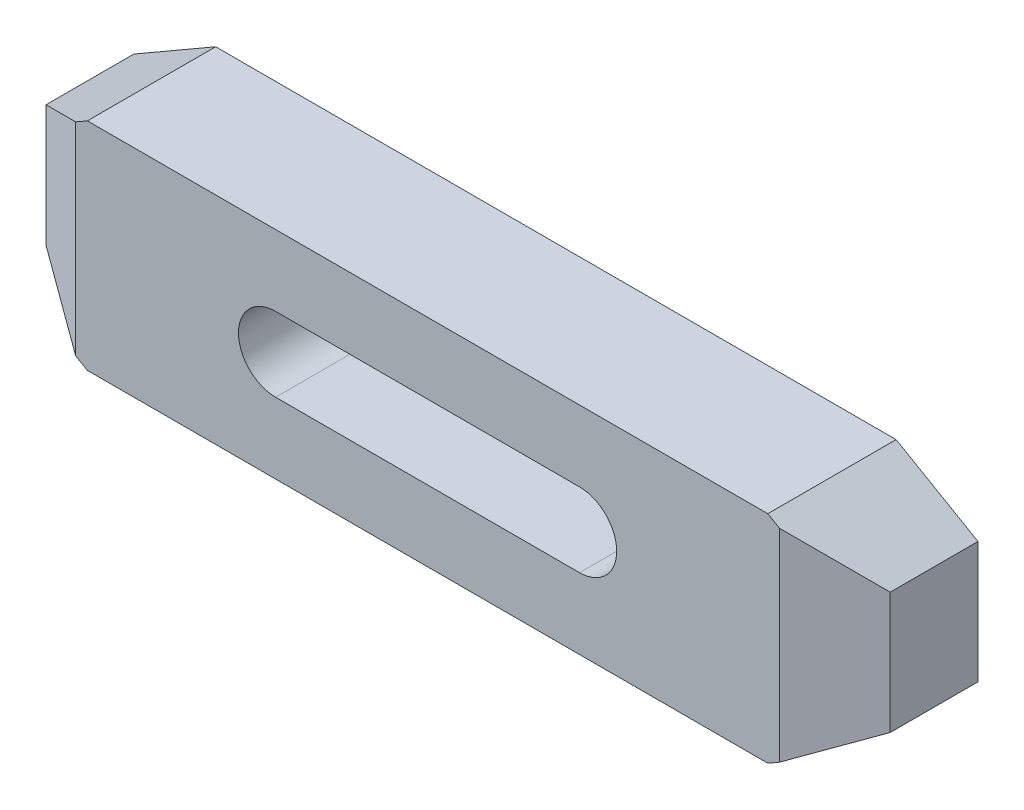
ISO-10303-21;
HEADER;
FILE_DESCRIPTION(('STEP AP214'),'2;1');
FILE_NAME('part.step','',(''),(''),'','','');
FILE_SCHEMA(('AUTOMOTIVE_DESIGN { 1 0 10303 214 1 1 1 1 }'));
ENDSEC;
DATA;
#1=APPLICATION_CONTEXT('core data for automotive mechanical design processes');
#2=APPLICATION_PROTOCOL_DEFINITION('international standard','automotive_design',2000,#1);
#3=PRODUCT_CONTEXT('',#1,'mechanical');
#4=PRODUCT('Part','Part','',(#3));
#5=PRODUCT_RELATED_PRODUCT_CATEGORY('part','',(#4));
#6=PRODUCT_DEFINITION_FORMATION('','',#4);
#7=PRODUCT_DEFINITION_CONTEXT('part definition',#1,'design');
#8=PRODUCT_DEFINITION('design','',#6,#7);
#9=PRODUCT_DEFINITION_SHAPE('','',#8);
#10=(LENGTH_UNIT() NAMED_UNIT(*) SI_UNIT(.MILLI.,.METRE.));
#11=(NAMED_UNIT(*) PLANE_ANGLE_UNIT() SI_UNIT($,.RADIAN.));
#12=(NAMED_UNIT(*) SI_UNIT($,.STERADIAN.) SOLID_ANGLE_UNIT());
#13=UNCERTAINTY_MEASURE_WITH_UNIT(LENGTH_MEASURE(1.E-05),#10,'distance_accuracy_value','');
#14=(GEOMETRIC_REPRESENTATION_CONTEXT(3) GLOBAL_UNCERTAINTY_ASSIGNED_CONTEXT((#13)) GLOBAL_UNIT_ASSIGNED_CONTEXT((#10,
#11,#12)) REPRESENTATION_CONTEXT('',''));
#15=CARTESIAN_POINT('',(0.,0.,0.));
#16=DIRECTION('',(0.,0.,1.));
#17=DIRECTION('',(1.,0.,0.));
#18=AXIS2_PLACEMENT_3D('',#15,#16,#17);
#19=CARTESIAN_POINT('',(0.,-45.0843918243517,19.));
#20=DIRECTION('',(0.,0.,-1.));
#21=DIRECTION('',(-1.,0.,0.));
#22=AXIS2_PLACEMENT_3D('',#19,#20,#21);
#23=PLANE('',#22);
#24=CARTESIAN_POINT('',(22.5,0.,19.));
#25=DIRECTION('',(0.,0.,1.));
#26=DIRECTION('',(1.,0.,0.));
#27=AXIS2_PLACEMENT_3D('',#24,#25,#26);
#28=CIRCLE('',#27,5.5);
#29=CARTESIAN_POINT('',(22.5,-5.5,19.));
#30=VERTEX_POINT('',#29);
#31=CARTESIAN_POINT('',(22.5,5.5,19.));
#32=VERTEX_POINT('',#31);
#33=EDGE_CURVE('E221',#30,#32,#28,.T.);
#34=ORIENTED_EDGE('',*,*,#33,.F.);
#35=DIRECTION('',(-1.,0.,0.));
#36=VECTOR('',#35,1.);
#37=CARTESIAN_POINT('',(22.5,-5.5,19.));
#38=LINE('',#37,#36);
#39=CARTESIAN_POINT('',(-22.5,-5.5,19.));
#40=VERTEX_POINT('',#39);
#41=EDGE_CURVE('E220',#30,#40,#38,.T.);
#42=ORIENTED_EDGE('',*,*,#41,.T.);
#43=CARTESIAN_POINT('',(-22.5,0.,19.));
#44=DIRECTION('',(0.,0.,1.));
#45=DIRECTION('',(1.,0.,0.));
#46=AXIS2_PLACEMENT_3D('',#43,#44,#45);
#47=CIRCLE('',#46,5.5);
#48=CARTESIAN_POINT('',(-22.5,5.5,19.));
#49=VERTEX_POINT('',#48);
#50=EDGE_CURVE('E228',#49,#40,#47,.T.);
#51=ORIENTED_EDGE('',*,*,#50,.F.);
#52=DIRECTION('',(-1.,0.,0.));
#53=VECTOR('',#52,1.);
#54=CARTESIAN_POINT('',(22.5,5.5,19.));
#55=LINE('',#54,#53);
#56=EDGE_CURVE('E224',#32,#49,#55,.T.);
#57=ORIENTED_EDGE('',*,*,#56,.F.);
#58=EDGE_LOOP('',(#34,#42,#51,#57));
#59=FACE_BOUND('',#58,.T.);
#60=DIRECTION('',(0.,1.,0.));
#61=VECTOR('',#60,1.);
#62=CARTESIAN_POINT('',(-52.1076951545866,-45.0843918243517,19.));
#63=LINE('',#62,#61);
#64=CARTESIAN_POINT('',(-52.1076951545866,-15.,19.));
#65=VERTEX_POINT('',#64);
#66=CARTESIAN_POINT('',(-52.1076951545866,15.,19.));
#67=VERTEX_POINT('',#66);
#68=EDGE_CURVE('E115',#65,#67,#63,.T.);
#69=ORIENTED_EDGE('',*,*,#68,.F.);
#70=DIRECTION('',(-0.866025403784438,0.5,0.));
#71=VECTOR('',#70,1.);
#72=CARTESIAN_POINT('',(-50.3756443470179,-16.,19.));
#73=LINE('',#72,#71);
#74=CARTESIAN_POINT('',(-50.3756443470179,-16.,19.));
#75=VERTEX_POINT('',#74);
#76=EDGE_CURVE('E174',#75,#65,#73,.T.);
#77=ORIENTED_EDGE('',*,*,#76,.F.);
#78=DIRECTION('',(-1.,0.,0.));
#79=VECTOR('',#78,1.);
#80=CARTESIAN_POINT('',(50.3756443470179,-16.,19.));
#81=LINE('',#80,#79);
#82=CARTESIAN_POINT('',(50.3756443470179,-16.,19.));
#83=VERTEX_POINT('',#82);
#84=EDGE_CURVE('E177',#83,#75,#81,.T.);
#85=ORIENTED_EDGE('',*,*,#84,.F.);
#86=DIRECTION('',(-0.866025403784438,-0.5,0.));
#87=VECTOR('',#86,1.);
#88=CARTESIAN_POINT('',(62.5,-9.,19.));
#89=LINE('',#88,#87);
#90=CARTESIAN_POINT('',(52.1076951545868,-15.,19.));
#91=VERTEX_POINT('',#90);
#92=EDGE_CURVE('E157',#91,#83,#89,.T.);
#93=ORIENTED_EDGE('',*,*,#92,.F.);
#94=DIRECTION('',(0.,1.,0.));
#95=VECTOR('',#94,1.);
#96=CARTESIAN_POINT('',(52.1076951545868,-45.0843918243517,19.));
#97=LINE('',#96,#95);
#98=CARTESIAN_POINT('',(52.1076951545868,15.,19.));
#99=VERTEX_POINT('',#98);
#100=EDGE_CURVE('E146',#91,#99,#97,.T.);
#101=ORIENTED_EDGE('',*,*,#100,.T.);
#102=DIRECTION('',(0.866025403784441,-0.5,0.));
#103=VECTOR('',#102,1.);
#104=CARTESIAN_POINT('',(50.3756443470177,16.,19.));
#105=LINE('',#104,#103);
#106=CARTESIAN_POINT('',(50.3756443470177,16.,19.));
#107=VERTEX_POINT('',#106);
#108=EDGE_CURVE('E155',#107,#99,#105,.T.);
#109=ORIENTED_EDGE('',*,*,#108,.F.);
#110=DIRECTION('',(1.,0.,0.));
#111=VECTOR('',#110,1.);
#112=CARTESIAN_POINT('',(-50.3756443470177,16.,19.));
#113=LINE('',#112,#111);
#114=CARTESIAN_POINT('',(-50.3756443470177,16.,19.));
#115=VERTEX_POINT('',#114);
#116=EDGE_CURVE('E164',#115,#107,#113,.T.);
#117=ORIENTED_EDGE('',*,*,#116,.F.);
#118=DIRECTION('',(0.866025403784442,0.5,0.));
#119=VECTOR('',#118,1.);
#120=CARTESIAN_POINT('',(-62.5,9.,19.));
#121=LINE('',#120,#119);
#122=EDGE_CURVE('E167',#67,#115,#121,.T.);
#123=ORIENTED_EDGE('',*,*,#122,.F.);
#124=EDGE_LOOP('',(#69,#77,#85,#93,#101,#109,#117,#123));
#125=FACE_BOUND('',#124,.T.);
#126=ADVANCED_FACE('F14',(#59,#125),#23,.F.);
#127=CARTESIAN_POINT('',(-62.5,9.,19.));
#128=DIRECTION('',(-0.5,0.866025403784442,0.));
#129=DIRECTION('',(-0.866025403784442,-0.5,0.));
#130=AXIS2_PLACEMENT_3D('',#127,#128,#129);
#131=PLANE('',#130);
#132=DIRECTION('',(0.,0.,-1.));
#133=VECTOR('',#132,1.);
#134=CARTESIAN_POINT('',(-62.5,9.,19.));
#135=LINE('',#134,#133);
#136=CARTESIAN_POINT('',(-62.5,9.,13.));
#137=VERTEX_POINT('',#136);
#138=CARTESIAN_POINT('',(-62.5,9.,0.));
#139=VERTEX_POINT('',#138);
#140=EDGE_CURVE('E124',#137,#139,#135,.T.);
#141=ORIENTED_EDGE('',*,*,#140,.F.);
#142=DIRECTION('',(0.774596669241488,0.447213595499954,0.447213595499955));
#143=VECTOR('',#142,1.);
#144=CARTESIAN_POINT('',(-60.4215390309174,10.2,14.2));
#145=LINE('',#144,#143);
#146=EDGE_CURVE('E112',#137,#67,#145,.T.);
#147=ORIENTED_EDGE('',*,*,#146,.T.);
#148=ORIENTED_EDGE('',*,*,#122,.T.);
#149=DIRECTION('',(0.,0.,-1.));
#150=VECTOR('',#149,1.);
#151=CARTESIAN_POINT('',(-50.3756443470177,16.,19.));
#152=LINE('',#151,#150);
#153=CARTESIAN_POINT('',(-50.3756443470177,16.,0.));
#154=VERTEX_POINT('',#153);
#155=EDGE_CURVE('E132',#115,#154,#152,.T.);
#156=ORIENTED_EDGE('',*,*,#155,.T.);
#157=DIRECTION('',(0.866025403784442,0.5,0.));
#158=VECTOR('',#157,1.);
#159=CARTESIAN_POINT('',(-62.5,9.,0.));
#160=LINE('',#159,#158);
#161=EDGE_CURVE('E131',#139,#154,#160,.T.);
#162=ORIENTED_EDGE('',*,*,#161,.F.);
#163=EDGE_LOOP('',(#141,#147,#148,#156,#162));
#164=FACE_BOUND('',#163,.T.);
#165=ADVANCED_FACE('F129',(#164),#131,.T.);
#166=CARTESIAN_POINT('',(-62.5,-9.,19.));
#167=DIRECTION('',(-1.,0.,0.));
#168=DIRECTION('',(0.,0.,1.));
#169=AXIS2_PLACEMENT_3D('',#166,#167,#168);
#170=PLANE('',#169);
#171=DIRECTION('',(0.,0.,-1.));
#172=VECTOR('',#171,1.);
#173=CARTESIAN_POINT('',(-62.5,-9.,19.));
#174=LINE('',#173,#172);
#175=CARTESIAN_POINT('',(-62.5,-9.,13.));
#176=VERTEX_POINT('',#175);
#177=CARTESIAN_POINT('',(-62.5,-9.,0.));
#178=VERTEX_POINT('',#177);
#179=EDGE_CURVE('E126',#176,#178,#174,.T.);
#180=ORIENTED_EDGE('',*,*,#179,.F.);
#181=DIRECTION('',(0.,1.,0.));
#182=VECTOR('',#181,1.);
#183=CARTESIAN_POINT('',(-62.5,-20.,13.));
#184=LINE('',#183,#182);
#185=EDGE_CURVE('E29',#176,#137,#184,.T.);
#186=ORIENTED_EDGE('',*,*,#185,.T.);
#187=ORIENTED_EDGE('',*,*,#140,.T.);
#188=DIRECTION('',(0.,1.,0.));
#189=VECTOR('',#188,1.);
#190=CARTESIAN_POINT('',(-62.5,-9.,0.));
#191=LINE('',#190,#189);
#192=EDGE_CURVE('E199',#178,#139,#191,.T.);
#193=ORIENTED_EDGE('',*,*,#192,.F.);
#194=EDGE_LOOP('',(#180,#186,#187,#193));
#195=FACE_BOUND('',#194,.T.);
#196=ADVANCED_FACE('F122',(#195),#170,.T.);
#197=CARTESIAN_POINT('',(-50.3756443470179,-16.,19.));
#198=DIRECTION('',(-0.5,-0.866025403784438,0.));
#199=DIRECTION('',(0.866025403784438,-0.5,0.));
#200=AXIS2_PLACEMENT_3D('',#197,#198,#199);
#201=PLANE('',#200);
#202=ORIENTED_EDGE('',*,*,#76,.T.);
#203=DIRECTION('',(-0.774596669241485,0.447213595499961,-0.447213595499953));
#204=VECTOR('',#203,1.);
#205=CARTESIAN_POINT('',(-50.7220545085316,-15.8,19.8));
#206=LINE('',#205,#204);
#207=EDGE_CURVE('E9',#65,#176,#206,.T.);
#208=ORIENTED_EDGE('',*,*,#207,.T.);
#209=ORIENTED_EDGE('',*,*,#179,.T.);
#210=DIRECTION('',(-0.866025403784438,0.5,0.));
#211=VECTOR('',#210,1.);
#212=CARTESIAN_POINT('',(-50.3756443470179,-16.,0.));
#213=LINE('',#212,#211);
#214=CARTESIAN_POINT('',(-50.3756443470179,-16.,0.));
#215=VERTEX_POINT('',#214);
#216=EDGE_CURVE('E195',#215,#178,#213,.T.);
#217=ORIENTED_EDGE('',*,*,#216,.F.);
#218=DIRECTION('',(0.,0.,-1.));
#219=VECTOR('',#218,1.);
#220=CARTESIAN_POINT('',(-50.3756443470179,-16.,19.));
#221=LINE('',#220,#219);
#222=EDGE_CURVE('E136',#75,#215,#221,.T.);
#223=ORIENTED_EDGE('',*,*,#222,.F.);
#224=EDGE_LOOP('',(#202,#208,#209,#217,#223));
#225=FACE_BOUND('',#224,.T.);
#226=ADVANCED_FACE('F198',(#225),#201,.T.);
#227=CARTESIAN_POINT('',(0.,-45.0843918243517,0.));
#228=DIRECTION('',(0.,0.,-1.));
#229=DIRECTION('',(-1.,0.,0.));
#230=AXIS2_PLACEMENT_3D('',#227,#228,#229);
#231=PLANE('',#230);
#232=DIRECTION('',(-0.866025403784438,-0.5,0.));
#233=VECTOR('',#232,1.);
#234=CARTESIAN_POINT('',(62.5,-9.,0.));
#235=LINE('',#234,#233);
#236=CARTESIAN_POINT('',(62.5,-9.,0.));
#237=VERTEX_POINT('',#236);
#238=CARTESIAN_POINT('',(50.3756443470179,-16.,0.));
#239=VERTEX_POINT('',#238);
#240=EDGE_CURVE('E170',#237,#239,#235,.T.);
#241=ORIENTED_EDGE('',*,*,#240,.T.);
#242=DIRECTION('',(-1.,0.,0.));
#243=VECTOR('',#242,1.);
#244=CARTESIAN_POINT('',(50.3756443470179,-16.,0.));
#245=LINE('',#244,#243);
#246=EDGE_CURVE('E186',#239,#215,#245,.T.);
#247=ORIENTED_EDGE('',*,*,#246,.T.);
#248=ORIENTED_EDGE('',*,*,#216,.T.);
#249=ORIENTED_EDGE('',*,*,#192,.T.);
#250=ORIENTED_EDGE('',*,*,#161,.T.);
#251=DIRECTION('',(1.,0.,0.));
#252=VECTOR('',#251,1.);
#253=CARTESIAN_POINT('',(-50.3756443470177,16.,0.));
#254=LINE('',#253,#252);
#255=CARTESIAN_POINT('',(50.3756443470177,16.,0.));
#256=VERTEX_POINT('',#255);
#257=EDGE_CURVE('E204',#154,#256,#254,.T.);
#258=ORIENTED_EDGE('',*,*,#257,.T.);
#259=DIRECTION('',(0.866025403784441,-0.5,0.));
#260=VECTOR('',#259,1.);
#261=CARTESIAN_POINT('',(50.3756443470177,16.,0.));
#262=LINE('',#261,#260);
#263=CARTESIAN_POINT('',(62.5,9.,0.));
#264=VERTEX_POINT('',#263);
#265=EDGE_CURVE('E207',#256,#264,#262,.T.);
#266=ORIENTED_EDGE('',*,*,#265,.T.);
#267=DIRECTION('',(0.,-1.,0.));
#268=VECTOR('',#267,1.);
#269=CARTESIAN_POINT('',(62.5,9.,0.));
#270=LINE('',#269,#268);
#271=EDGE_CURVE('E180',#264,#237,#270,.T.);
#272=ORIENTED_EDGE('',*,*,#271,.T.);
#273=EDGE_LOOP('',(#241,#247,#248,#249,#250,#258,#266,#272));
#274=FACE_BOUND('',#273,.T.);
#275=DIRECTION('',(-1.,0.,0.));
#276=VECTOR('',#275,1.);
#277=CARTESIAN_POINT('',(22.5,-5.5,0.));
#278=LINE('',#277,#276);
#279=CARTESIAN_POINT('',(22.5,-5.5,0.));
#280=VERTEX_POINT('',#279);
#281=CARTESIAN_POINT('',(-22.5,-5.5,0.));
#282=VERTEX_POINT('',#281);
#283=EDGE_CURVE('E225',#280,#282,#278,.T.);
#284=ORIENTED_EDGE('',*,*,#283,.F.);
#285=CARTESIAN_POINT('',(22.5,0.,0.));
#286=DIRECTION('',(0.,0.,1.));
#287=DIRECTION('',(1.,0.,0.));
#288=AXIS2_PLACEMENT_3D('',#285,#286,#287);
#289=CIRCLE('',#288,5.5);
#290=CARTESIAN_POINT('',(22.5,5.5,0.));
#291=VERTEX_POINT('',#290);
#292=EDGE_CURVE('E232',#280,#291,#289,.T.);
#293=ORIENTED_EDGE('',*,*,#292,.T.);
#294=DIRECTION('',(-1.,0.,0.));
#295=VECTOR('',#294,1.);
#296=CARTESIAN_POINT('',(22.5,5.5,0.));
#297=LINE('',#296,#295);
#298=CARTESIAN_POINT('',(-22.5,5.5,0.));
#299=VERTEX_POINT('',#298);
#300=EDGE_CURVE('E235',#291,#299,#297,.T.);
#301=ORIENTED_EDGE('',*,*,#300,.T.);
#302=CARTESIAN_POINT('',(-22.5,0.,0.));
#303=DIRECTION('',(0.,0.,1.));
#304=DIRECTION('',(1.,0.,0.));
#305=AXIS2_PLACEMENT_3D('',#302,#303,#304);
#306=CIRCLE('',#305,5.5);
#307=EDGE_CURVE('E238',#299,#282,#306,.T.);
#308=ORIENTED_EDGE('',*,*,#307,.T.);
#309=EDGE_LOOP('',(#284,#293,#301,#308));
#310=FACE_BOUND('',#309,.T.);
#311=ADVANCED_FACE('F193',(#274,#310),#231,.T.);
#312=CARTESIAN_POINT('',(62.5,-9.,19.));
#313=DIRECTION('',(0.5,-0.866025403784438,0.));
#314=DIRECTION('',(0.866025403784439,0.5,0.));
#315=AXIS2_PLACEMENT_3D('',#312,#313,#314);
#316=PLANE('',#315);
#317=DIRECTION('',(0.774596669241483,0.447213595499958,-0.447213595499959));
#318=VECTOR('',#317,1.);
#319=CARTESIAN_POINT('',(60.4215390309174,-10.2,14.2));
#320=LINE('',#319,#318);
#321=CARTESIAN_POINT('',(62.5,-9.,13.));
#322=VERTEX_POINT('',#321);
#323=EDGE_CURVE('E158',#91,#322,#320,.T.);
#324=ORIENTED_EDGE('',*,*,#323,.F.);
#325=ORIENTED_EDGE('',*,*,#92,.T.);
#326=DIRECTION('',(0.,0.,-1.));
#327=VECTOR('',#326,1.);
#328=CARTESIAN_POINT('',(50.3756443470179,-16.,19.));
#329=LINE('',#328,#327);
#330=EDGE_CURVE('E163',#83,#239,#329,.T.);
#331=ORIENTED_EDGE('',*,*,#330,.T.);
#332=ORIENTED_EDGE('',*,*,#240,.F.);
#333=DIRECTION('',(0.,0.,-1.));
#334=VECTOR('',#333,1.);
#335=CARTESIAN_POINT('',(62.5,-9.,19.));
#336=LINE('',#335,#334);
#337=EDGE_CURVE('E143',#322,#237,#336,.T.);
#338=ORIENTED_EDGE('',*,*,#337,.F.);
#339=EDGE_LOOP('',(#324,#325,#331,#332,#338));
#340=FACE_BOUND('',#339,.T.);
#341=ADVANCED_FACE('F249',(#340),#316,.T.);
#342=CARTESIAN_POINT('',(62.5,9.,19.));
#343=DIRECTION('',(1.,0.,0.));
#344=DIRECTION('',(0.,0.,-1.));
#345=AXIS2_PLACEMENT_3D('',#342,#343,#344);
#346=PLANE('',#345);
#347=DIRECTION('',(0.,1.,0.));
#348=VECTOR('',#347,1.);
#349=CARTESIAN_POINT('',(62.5,-20.,13.));
#350=LINE('',#349,#348);
#351=CARTESIAN_POINT('',(62.5,9.,13.));
#352=VERTEX_POINT('',#351);
#353=EDGE_CURVE('E36',#322,#352,#350,.T.);
#354=ORIENTED_EDGE('',*,*,#353,.F.);
#355=ORIENTED_EDGE('',*,*,#337,.T.);
#356=ORIENTED_EDGE('',*,*,#271,.F.);
#357=DIRECTION('',(0.,0.,-1.));
#358=VECTOR('',#357,1.);
#359=CARTESIAN_POINT('',(62.5,9.,19.));
#360=LINE('',#359,#358);
#361=EDGE_CURVE('E141',#352,#264,#360,.T.);
#362=ORIENTED_EDGE('',*,*,#361,.F.);
#363=EDGE_LOOP('',(#354,#355,#356,#362));
#364=FACE_BOUND('',#363,.T.);
#365=ADVANCED_FACE('F16',(#364),#346,.T.);
#366=CARTESIAN_POINT('',(50.3756443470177,16.,19.));
#367=DIRECTION('',(0.5,0.866025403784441,0.));
#368=DIRECTION('',(-0.866025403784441,0.5,0.));
#369=AXIS2_PLACEMENT_3D('',#366,#367,#368);
#370=PLANE('',#369);
#371=DIRECTION('',(-0.774596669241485,0.447213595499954,0.44721359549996));
#372=VECTOR('',#371,1.);
#373=CARTESIAN_POINT('',(50.7220545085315,15.8,19.8));
#374=LINE('',#373,#372);
#375=EDGE_CURVE('E22',#352,#99,#374,.T.);
#376=ORIENTED_EDGE('',*,*,#375,.F.);
#377=ORIENTED_EDGE('',*,*,#361,.T.);
#378=ORIENTED_EDGE('',*,*,#265,.F.);
#379=DIRECTION('',(0.,0.,-1.));
#380=VECTOR('',#379,1.);
#381=CARTESIAN_POINT('',(50.3756443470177,16.,19.));
#382=LINE('',#381,#380);
#383=EDGE_CURVE('E134',#107,#256,#382,.T.);
#384=ORIENTED_EDGE('',*,*,#383,.F.);
#385=ORIENTED_EDGE('',*,*,#108,.T.);
#386=EDGE_LOOP('',(#376,#377,#378,#384,#385));
#387=FACE_BOUND('',#386,.T.);
#388=ADVANCED_FACE('F160',(#387),#370,.T.);
#389=CARTESIAN_POINT('',(-50.3756443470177,16.,19.));
#390=DIRECTION('',(0.,1.,0.));
#391=DIRECTION('',(0.,0.,1.));
#392=AXIS2_PLACEMENT_3D('',#389,#390,#391);
#393=PLANE('',#392);
#394=ORIENTED_EDGE('',*,*,#155,.F.);
#395=ORIENTED_EDGE('',*,*,#116,.T.);
#396=ORIENTED_EDGE('',*,*,#383,.T.);
#397=ORIENTED_EDGE('',*,*,#257,.F.);
#398=EDGE_LOOP('',(#394,#395,#396,#397));
#399=FACE_BOUND('',#398,.T.);
#400=ADVANCED_FACE('F253',(#399),#393,.T.);
#401=CARTESIAN_POINT('',(50.3756443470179,-16.,19.));
#402=DIRECTION('',(0.,-1.,0.));
#403=DIRECTION('',(1.,0.,0.));
#404=AXIS2_PLACEMENT_3D('',#401,#402,#403);
#405=PLANE('',#404);
#406=ORIENTED_EDGE('',*,*,#84,.T.);
#407=ORIENTED_EDGE('',*,*,#222,.T.);
#408=ORIENTED_EDGE('',*,*,#246,.F.);
#409=ORIENTED_EDGE('',*,*,#330,.F.);
#410=EDGE_LOOP('',(#406,#407,#408,#409));
#411=FACE_BOUND('',#410,.T.);
#412=ADVANCED_FACE('F184',(#411),#405,.T.);
#413=CARTESIAN_POINT('',(22.5,0.,19.));
#414=DIRECTION('',(0.,0.,-1.));
#415=DIRECTION('',(-1.,0.,0.));
#416=AXIS2_PLACEMENT_3D('',#413,#414,#415);
#417=CYLINDRICAL_SURFACE('',#416,5.5);
#418=DIRECTION('',(0.,0.,-1.));
#419=VECTOR('',#418,1.);
#420=CARTESIAN_POINT('',(22.5,5.5,19.));
#421=LINE('',#420,#419);
#422=EDGE_CURVE('E211',#32,#291,#421,.T.);
#423=ORIENTED_EDGE('',*,*,#422,.T.);
#424=ORIENTED_EDGE('',*,*,#292,.F.);
#425=DIRECTION('',(0.,0.,-1.));
#426=VECTOR('',#425,1.);
#427=CARTESIAN_POINT('',(22.5,-5.5,19.));
#428=LINE('',#427,#426);
#429=EDGE_CURVE('E217',#30,#280,#428,.T.);
#430=ORIENTED_EDGE('',*,*,#429,.F.);
#431=ORIENTED_EDGE('',*,*,#33,.T.);
#432=EDGE_LOOP('',(#423,#424,#430,#431));
#433=FACE_BOUND('',#432,.T.);
#434=ADVANCED_FACE('F261',(#433),#417,.F.);
#435=CARTESIAN_POINT('',(22.5,5.5,19.));
#436=DIRECTION('',(0.,-1.,0.));
#437=DIRECTION('',(1.,0.,0.));
#438=AXIS2_PLACEMENT_3D('',#435,#436,#437);
#439=PLANE('',#438);
#440=DIRECTION('',(0.,0.,-1.));
#441=VECTOR('',#440,1.);
#442=CARTESIAN_POINT('',(-22.5,5.5,19.));
#443=LINE('',#442,#441);
#444=EDGE_CURVE('E213',#49,#299,#443,.T.);
#445=ORIENTED_EDGE('',*,*,#444,.T.);
#446=ORIENTED_EDGE('',*,*,#300,.F.);
#447=ORIENTED_EDGE('',*,*,#422,.F.);
#448=ORIENTED_EDGE('',*,*,#56,.T.);
#449=EDGE_LOOP('',(#445,#446,#447,#448));
#450=FACE_BOUND('',#449,.T.);
#451=ADVANCED_FACE('F336',(#450),#439,.T.);
#452=CARTESIAN_POINT('',(-22.5,0.,19.));
#453=DIRECTION('',(0.,0.,-1.));
#454=DIRECTION('',(-1.,0.,0.));
#455=AXIS2_PLACEMENT_3D('',#452,#453,#454);
#456=CYLINDRICAL_SURFACE('',#455,5.5);
#457=DIRECTION('',(0.,0.,-1.));
#458=VECTOR('',#457,1.);
#459=CARTESIAN_POINT('',(-22.5,-5.5,19.));
#460=LINE('',#459,#458);
#461=EDGE_CURVE('E215',#40,#282,#460,.T.);
#462=ORIENTED_EDGE('',*,*,#461,.T.);
#463=ORIENTED_EDGE('',*,*,#307,.F.);
#464=ORIENTED_EDGE('',*,*,#444,.F.);
#465=ORIENTED_EDGE('',*,*,#50,.T.);
#466=EDGE_LOOP('',(#462,#463,#464,#465));
#467=FACE_BOUND('',#466,.T.);
#468=ADVANCED_FACE('F346',(#467),#456,.F.);
#469=CARTESIAN_POINT('',(22.5,-5.5,19.));
#470=DIRECTION('',(0.,-1.,0.));
#471=DIRECTION('',(1.,0.,0.));
#472=AXIS2_PLACEMENT_3D('',#469,#470,#471);
#473=PLANE('',#472);
#474=ORIENTED_EDGE('',*,*,#41,.F.);
#475=ORIENTED_EDGE('',*,*,#429,.T.);
#476=ORIENTED_EDGE('',*,*,#283,.T.);
#477=ORIENTED_EDGE('',*,*,#461,.F.);
#478=EDGE_LOOP('',(#474,#475,#476,#477));
#479=FACE_BOUND('',#478,.T.);
#480=ADVANCED_FACE('F355',(#479),#473,.F.);
#481=CARTESIAN_POINT('',(62.5,-20.,13.));
#482=DIRECTION('',(-0.5,0.,-0.866025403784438));
#483=DIRECTION('',(-0.866025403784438,0.,0.5));
#484=AXIS2_PLACEMENT_3D('',#481,#482,#483);
#485=PLANE('',#484);
#486=ORIENTED_EDGE('',*,*,#323,.T.);
#487=ORIENTED_EDGE('',*,*,#353,.T.);
#488=ORIENTED_EDGE('',*,*,#375,.T.);
#489=ORIENTED_EDGE('',*,*,#100,.F.);
#490=EDGE_LOOP('',(#486,#487,#488,#489));
#491=FACE_BOUND('',#490,.T.);
#492=ADVANCED_FACE('F145',(#491),#485,.F.);
#493=CARTESIAN_POINT('',(-62.5,-20.,13.));
#494=DIRECTION('',(-0.5,0.,0.866025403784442));
#495=DIRECTION('',(0.866025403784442,0.,0.5));
#496=AXIS2_PLACEMENT_3D('',#493,#494,#495);
#497=PLANE('',#496);
#498=ORIENTED_EDGE('',*,*,#185,.F.);
#499=ORIENTED_EDGE('',*,*,#207,.F.);
#500=ORIENTED_EDGE('',*,*,#68,.T.);
#501=ORIENTED_EDGE('',*,*,#146,.F.);
#502=EDGE_LOOP('',(#498,#499,#500,#501));
#503=FACE_BOUND('',#502,.T.);
#504=ADVANCED_FACE('F113',(#503),#497,.T.);
#505=CLOSED_SHELL('',(#126,#165,#196,#226,#311,#341,#365,#388,#400,#412,#434,#451,#468,#480,
#492,#504));
#506=MANIFOLD_SOLID_BREP('B1',#505);
#507=ADVANCED_BREP_SHAPE_REPRESENTATION('',(#18,#506),#14);
#508=SHAPE_DEFINITION_REPRESENTATION(#9,#507);
ENDSEC;
END-ISO-10303-21;
